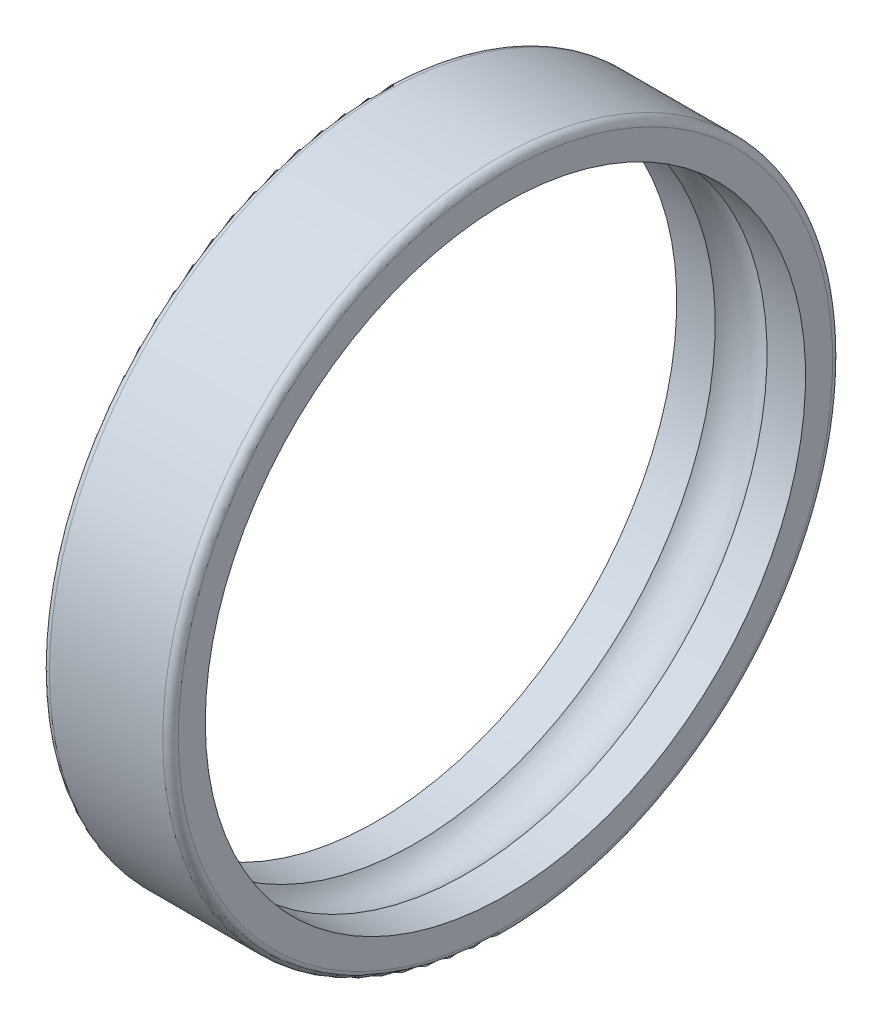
from build123d import *


with BuildPart() as part:
    # Esquisse1 → Base-R_volution (revolve)
    with BuildSketch(Plane(origin=(0, 0, 0), x_dir=(1, 0, 0), z_dir=(0, 1, 0)), mode=Mode.PRIVATE) as base_r_volution_sk:
        with BuildLine():
            Line((0, 12.7), (0, 11.65))
            Line((0, 11.65), (1.49376941, 11.65))
            ThreePointArc((1.49376941, 11.65), (2.5, 12.1), (3.50623059, 11.65))
            Line((3.50623059, 11.65), (5, 11.65))
            Line((5, 11.65), (5, 12.7))
            ThreePointArc((5, 12.7), (4.912132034, 12.912132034), (4.7, 13))
            Line((4.7, 13), (0.3, 13))
            ThreePointArc((0.3, 13), (0.087867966, 12.912132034), (0, 12.7))
        make_face()
    revolve(base_r_volution_sk.sketch.rotate(Axis((0, 0, 0), (1, 0, 0)), 180), axis=Axis((0, 0, 0), (1, 0, 0)))


solid = part.part
